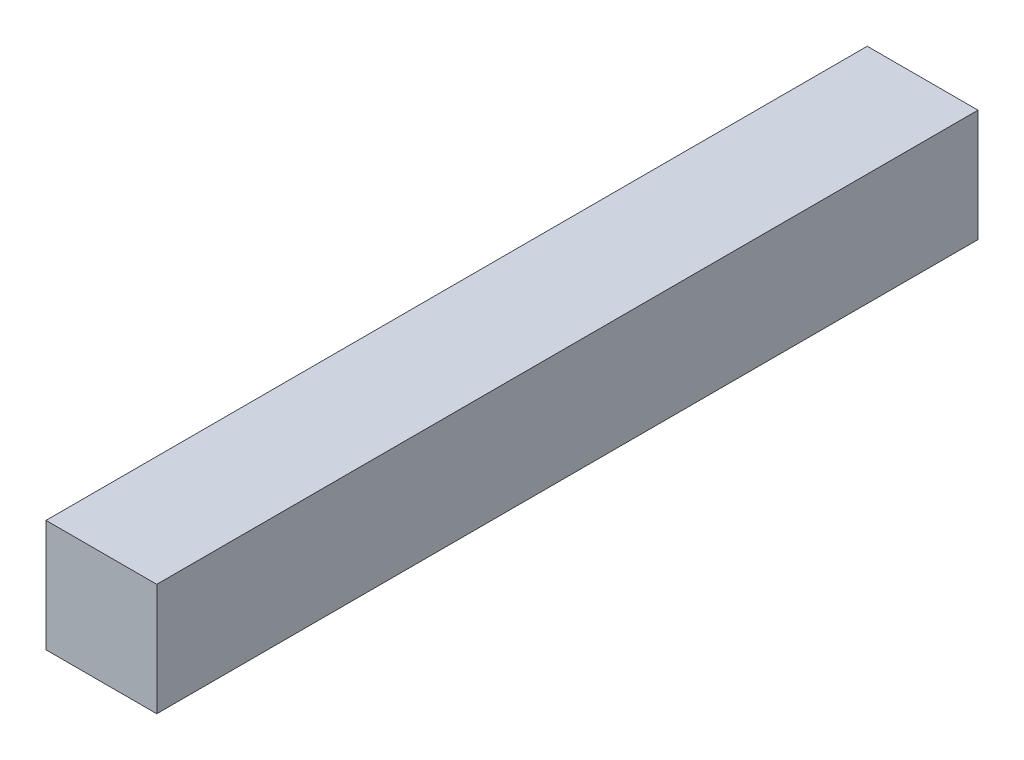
from build123d import *

# Parameters (mm, degrees)
SKETCH1_W           = 5.9944
SKETCH1_H           = 6.06810164
BOSS_EXTRUDE1_DEPTH = 44.45


with BuildPart() as part:
    # Sketch1 → Boss-Extrude1 (new body)
    with BuildSketch(Plane.XY):
        Rectangle(SKETCH1_W, SKETCH1_H)
    extrude(amount=BOSS_EXTRUDE1_DEPTH)


solid = part.part
